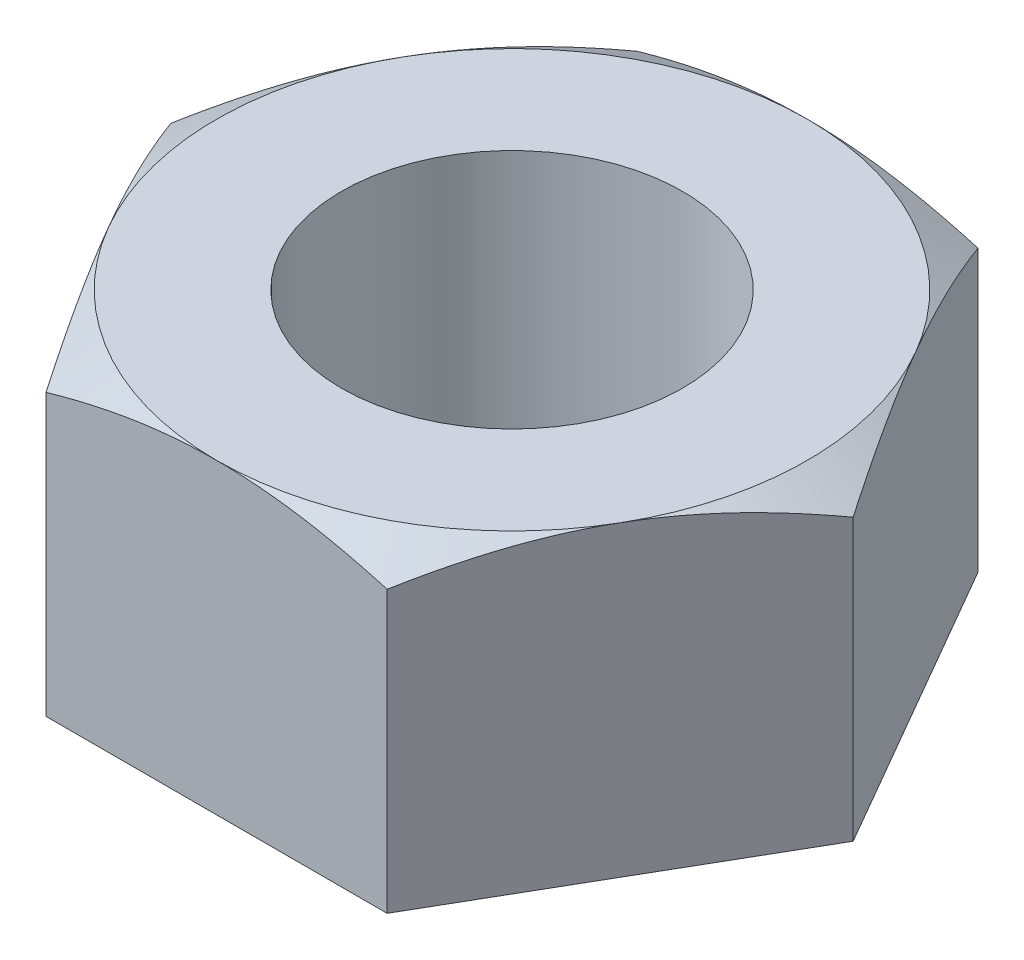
ISO-10303-21;
HEADER;
FILE_DESCRIPTION(('STEP AP214'),'2;1');
FILE_NAME('part.step','',(''),(''),'','','');
FILE_SCHEMA(('AUTOMOTIVE_DESIGN { 1 0 10303 214 1 1 1 1 }'));
ENDSEC;
DATA;
#1=APPLICATION_CONTEXT('core data for automotive mechanical design processes');
#2=APPLICATION_PROTOCOL_DEFINITION('international standard','automotive_design',2000,#1);
#3=PRODUCT_CONTEXT('',#1,'mechanical');
#4=PRODUCT('Part','Part','',(#3));
#5=PRODUCT_RELATED_PRODUCT_CATEGORY('part','',(#4));
#6=PRODUCT_DEFINITION_FORMATION('','',#4);
#7=PRODUCT_DEFINITION_CONTEXT('part definition',#1,'design');
#8=PRODUCT_DEFINITION('design','',#6,#7);
#9=PRODUCT_DEFINITION_SHAPE('','',#8);
#10=(LENGTH_UNIT() NAMED_UNIT(*) SI_UNIT(.MILLI.,.METRE.));
#11=(NAMED_UNIT(*) PLANE_ANGLE_UNIT() SI_UNIT($,.RADIAN.));
#12=(NAMED_UNIT(*) SI_UNIT($,.STERADIAN.) SOLID_ANGLE_UNIT());
#13=UNCERTAINTY_MEASURE_WITH_UNIT(LENGTH_MEASURE(1.E-05),#10,'distance_accuracy_value','');
#14=(GEOMETRIC_REPRESENTATION_CONTEXT(3) GLOBAL_UNCERTAINTY_ASSIGNED_CONTEXT((#13)) GLOBAL_UNIT_ASSIGNED_CONTEXT((#10,
#11,#12)) REPRESENTATION_CONTEXT('',''));
#15=CARTESIAN_POINT('',(0.,0.,0.));
#16=DIRECTION('',(0.,0.,1.));
#17=DIRECTION('',(1.,0.,0.));
#18=AXIS2_PLACEMENT_3D('',#15,#16,#17);
#19=CARTESIAN_POINT('',(9.99999999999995,9.,0.));
#20=DIRECTION('',(0.,1.,0.));
#21=DIRECTION('',(0.,0.,1.));
#22=AXIS2_PLACEMENT_3D('',#19,#20,#21);
#23=PLANE('',#22);
#24=CARTESIAN_POINT('',(0.,9.,0.));
#25=DIRECTION('',(0.,1.,0.));
#26=DIRECTION('',(0.,0.,1.));
#27=AXIS2_PLACEMENT_3D('',#24,#25,#26);
#28=CIRCLE('',#27,5.);
#29=CARTESIAN_POINT('',(0.,9.,5.));
#30=VERTEX_POINT('',#29);
#31=EDGE_CURVE('E245',#30,#30,#28,.T.);
#32=ORIENTED_EDGE('',*,*,#31,.F.);
#33=EDGE_LOOP('',(#32));
#34=FACE_BOUND('',#33,.T.);
#35=CARTESIAN_POINT('',(0.,9.,0.));
#36=DIRECTION('',(0.,1.,0.));
#37=DIRECTION('',(-1.,0.,0.));
#38=AXIS2_PLACEMENT_3D('',#35,#36,#37);
#39=CIRCLE('',#38,8.66025403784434);
#40=CARTESIAN_POINT('',(-7.49999999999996,8.99999999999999,4.33012701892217));
#41=VERTEX_POINT('',#40);
#42=CARTESIAN_POINT('',(0.,9.,8.66025403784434));
#43=VERTEX_POINT('',#42);
#44=EDGE_CURVE('E134',#41,#43,#39,.T.);
#45=ORIENTED_EDGE('',*,*,#44,.T.);
#46=CARTESIAN_POINT('',(7.49999999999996,9.,4.33012701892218));
#47=VERTEX_POINT('',#46);
#48=EDGE_CURVE('E118',#43,#47,#39,.T.);
#49=ORIENTED_EDGE('',*,*,#48,.T.);
#50=CARTESIAN_POINT('',(7.49999999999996,9.,-4.33012701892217));
#51=VERTEX_POINT('',#50);
#52=EDGE_CURVE('E108',#47,#51,#39,.T.);
#53=ORIENTED_EDGE('',*,*,#52,.T.);
#54=CARTESIAN_POINT('',(0.,9.,-8.66025403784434));
#55=VERTEX_POINT('',#54);
#56=EDGE_CURVE('E52',#51,#55,#39,.T.);
#57=ORIENTED_EDGE('',*,*,#56,.T.);
#58=CARTESIAN_POINT('',(-7.49999999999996,8.99999999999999,-4.33012701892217));
#59=VERTEX_POINT('',#58);
#60=EDGE_CURVE('E60',#55,#59,#39,.T.);
#61=ORIENTED_EDGE('',*,*,#60,.T.);
#62=EDGE_CURVE('E136',#59,#41,#39,.T.);
#63=ORIENTED_EDGE('',*,*,#62,.T.);
#64=EDGE_LOOP('',(#45,#49,#53,#57,#61,#63));
#65=FACE_BOUND('',#64,.T.);
#66=ADVANCED_FACE('F31',(#34,#65),#23,.T.);
#67=CARTESIAN_POINT('',(4.99999999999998,9.,8.66025403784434));
#68=DIRECTION('',(-0.866025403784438,0.,-0.5));
#69=DIRECTION('',(-0.5,0.,0.866025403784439));
#70=AXIS2_PLACEMENT_3D('',#67,#68,#69);
#71=PLANE('',#70);
#72=CARTESIAN_POINT('',(4.99988452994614,8.22643064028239,8.66045403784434));
#73=CARTESIAN_POINT('',(5.10978993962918,8.28987449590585,8.47009228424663));
#74=CARTESIAN_POINT('',(5.22010511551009,8.35043900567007,8.27902079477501));
#75=CARTESIAN_POINT('',(5.44163137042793,8.46501628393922,7.89532606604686));
#76=CARTESIAN_POINT('',(5.55284281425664,8.51902622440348,7.70270219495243));
#77=CARTESIAN_POINT('',(5.88825776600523,8.67016394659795,7.12174645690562));
#78=CARTESIAN_POINT('',(6.11378530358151,8.75612903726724,6.7311213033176));
#79=CARTESIAN_POINT('',(6.45128290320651,8.85693311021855,6.14655831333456));
#80=CARTESIAN_POINT('',(6.56224470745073,8.88564924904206,5.95436683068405));
#81=CARTESIAN_POINT('',(6.78467011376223,8.93380128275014,5.56911472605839));
#82=CARTESIAN_POINT('',(6.89613367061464,8.95323799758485,5.37605418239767));
#83=CARTESIAN_POINT('',(7.11925270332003,8.98233858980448,4.98960068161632));
#84=CARTESIAN_POINT('',(7.23090781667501,8.99201355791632,4.79620835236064));
#85=CARTESIAN_POINT('',(7.45432118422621,9.00138323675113,4.4092450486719));
#86=CARTESIAN_POINT('',(7.5660794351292,9.00107825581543,4.21567407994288));
#87=CARTESIAN_POINT('',(7.77501507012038,8.99118224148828,3.85378694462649));
#88=CARTESIAN_POINT('',(7.87220719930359,8.98279838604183,3.68544523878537));
#89=CARTESIAN_POINT('',(8.0663638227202,8.95864535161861,3.34915610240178));
#90=CARTESIAN_POINT('',(8.16332830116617,8.94287567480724,3.18120869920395));
#91=CARTESIAN_POINT('',(8.45384634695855,8.88486066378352,2.67801668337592));
#92=CARTESIAN_POINT('',(8.64688567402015,8.83191659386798,2.34366276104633));
#93=CARTESIAN_POINT('',(9.03501203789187,8.69955567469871,1.67140817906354));
#94=CARTESIAN_POINT('',(9.23004954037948,8.61957775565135,1.33359331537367));
#95=CARTESIAN_POINT('',(9.61721603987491,8.43806099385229,0.663001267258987));
#96=CARTESIAN_POINT('',(9.80934999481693,8.33656478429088,0.330215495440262));
#97=CARTESIAN_POINT('',(10.0001154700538,8.22643064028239,-0.000199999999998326));
#98=B_SPLINE_CURVE_WITH_KNOTS('',3,(#72,#73,#74,#75,#76,#77,#78,#79,#80,#81,#82,#83,#84,#85,#86,
#87,#88,#89,#90,#91,#92,#93,#94,#95,#96,#97),.UNSPECIFIED.,.F.,.F.,(4,2,2,2,2,2,2,2,2,2,2,2,4),
(0.,0.686295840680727,1.37288674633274,2.74892125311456,3.42008636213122,4.09119215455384,
4.76153461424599,5.43185636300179,6.01540583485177,6.5989946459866,7.76700355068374,
8.96091644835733,10.1524856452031),.UNSPECIFIED.);
#99=CARTESIAN_POINT('',(4.99999999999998,8.22649730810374,8.66025403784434));
#100=VERTEX_POINT('',#99);
#101=EDGE_CURVE('E123',#100,#47,#98,.T.);
#102=ORIENTED_EDGE('',*,*,#101,.F.);
#103=DIRECTION('',(0.,-1.,0.));
#104=VECTOR('',#103,1.);
#105=CARTESIAN_POINT('',(4.99999999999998,9.,8.66025403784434));
#106=LINE('',#105,#104);
#107=CARTESIAN_POINT('',(4.99999999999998,0.,8.66025403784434));
#108=VERTEX_POINT('',#107);
#109=EDGE_CURVE('E223',#100,#108,#106,.T.);
#110=ORIENTED_EDGE('',*,*,#109,.T.);
#111=DIRECTION('',(0.5,0.,-0.866025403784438));
#112=VECTOR('',#111,1.);
#113=CARTESIAN_POINT('',(4.99999999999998,0.,8.66025403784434));
#114=LINE('',#113,#112);
#115=CARTESIAN_POINT('',(9.99999999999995,0.,0.));
#116=VERTEX_POINT('',#115);
#117=EDGE_CURVE('E240',#108,#116,#114,.T.);
#118=ORIENTED_EDGE('',*,*,#117,.T.);
#119=DIRECTION('',(0.,-1.,0.));
#120=VECTOR('',#119,1.);
#121=CARTESIAN_POINT('',(9.99999999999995,9.,0.));
#122=LINE('',#121,#120);
#123=CARTESIAN_POINT('',(9.99999999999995,8.22649730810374,0.));
#124=VERTEX_POINT('',#123);
#125=EDGE_CURVE('E131',#124,#116,#122,.T.);
#126=ORIENTED_EDGE('',*,*,#125,.F.);
#127=EDGE_CURVE('E112',#47,#124,#98,.T.);
#128=ORIENTED_EDGE('',*,*,#127,.F.);
#129=EDGE_LOOP('',(#102,#110,#118,#126,#128));
#130=FACE_BOUND('',#129,.T.);
#131=ADVANCED_FACE('F33',(#130),#71,.F.);
#132=CARTESIAN_POINT('',(9.99999999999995,9.,0.));
#133=DIRECTION('',(-0.866025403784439,0.,0.5));
#134=DIRECTION('',(0.5,0.,0.866025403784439));
#135=AXIS2_PLACEMENT_3D('',#132,#133,#134);
#136=PLANE('',#135);
#137=CARTESIAN_POINT('',(10.0001154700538,8.22643064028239,0.000200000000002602));
#138=CARTESIAN_POINT('',(9.89021006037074,8.28987449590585,-0.190161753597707));
#139=CARTESIAN_POINT('',(9.77989488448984,8.35043900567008,-0.38123324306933));
#140=CARTESIAN_POINT('',(9.558368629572,8.46501628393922,-0.764927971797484));
#141=CARTESIAN_POINT('',(9.44715718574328,8.51902622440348,-0.957551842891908));
#142=CARTESIAN_POINT('',(9.1117422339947,8.67016394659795,-1.53850758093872));
#143=CARTESIAN_POINT('',(8.88621469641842,8.75612903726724,-1.92913273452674));
#144=CARTESIAN_POINT('',(8.54871709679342,8.85693311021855,-2.51369572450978));
#145=CARTESIAN_POINT('',(8.43775529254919,8.88564924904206,-2.70588720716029));
#146=CARTESIAN_POINT('',(8.2153298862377,8.93380128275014,-3.09113931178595));
#147=CARTESIAN_POINT('',(8.10386632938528,8.95323799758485,-3.28419985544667));
#148=CARTESIAN_POINT('',(7.8807472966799,8.98233858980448,-3.67065335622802));
#149=CARTESIAN_POINT('',(7.76909218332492,8.99201355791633,-3.8640456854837));
#150=CARTESIAN_POINT('',(7.54567881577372,9.00138323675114,-4.25100898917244));
#151=CARTESIAN_POINT('',(7.43392056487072,9.00107825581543,-4.44457995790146));
#152=CARTESIAN_POINT('',(7.22498492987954,8.99118224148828,-4.80646709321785));
#153=CARTESIAN_POINT('',(7.12779280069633,8.98279838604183,-4.97480879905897));
#154=CARTESIAN_POINT('',(6.93363617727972,8.95864535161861,-5.31109793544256));
#155=CARTESIAN_POINT('',(6.83667169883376,8.94287567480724,-5.47904533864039));
#156=CARTESIAN_POINT('',(6.54615365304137,8.88486066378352,-5.98223735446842));
#157=CARTESIAN_POINT('',(6.35311432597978,8.83191659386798,-6.31659127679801));
#158=CARTESIAN_POINT('',(5.96498796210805,8.69955567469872,-6.9888458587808));
#159=CARTESIAN_POINT('',(5.76995045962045,8.61957775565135,-7.32666072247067));
#160=CARTESIAN_POINT('',(5.38278396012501,8.43806099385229,-7.99725277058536));
#161=CARTESIAN_POINT('',(5.19065000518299,8.33656478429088,-8.33003854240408));
#162=CARTESIAN_POINT('',(4.99988452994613,8.22643064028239,-8.66045403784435));
#163=B_SPLINE_CURVE_WITH_KNOTS('',3,(#137,#138,#139,#140,#141,#142,#143,#144,#145,#146,#147,
#148,#149,#150,#151,#152,#153,#154,#155,#156,#157,#158,#159,#160,#161,#162),.UNSPECIFIED.,.F.,
.F.,(4,2,2,2,2,2,2,2,2,2,2,2,4),(0.,0.686295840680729,1.37288674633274,2.74892125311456,
3.42008636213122,4.09119215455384,4.76153461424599,5.43185636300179,6.01540583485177,
6.5989946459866,7.76700355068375,8.96091644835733,10.1524856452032),.UNSPECIFIED.);
#164=EDGE_CURVE('E114',#124,#51,#163,.T.);
#165=ORIENTED_EDGE('',*,*,#164,.F.);
#166=ORIENTED_EDGE('',*,*,#125,.T.);
#167=DIRECTION('',(-0.5,0.,-0.866025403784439));
#168=VECTOR('',#167,1.);
#169=CARTESIAN_POINT('',(9.99999999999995,0.,0.));
#170=LINE('',#169,#168);
#171=CARTESIAN_POINT('',(4.99999999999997,0.,-8.66025403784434));
#172=VERTEX_POINT('',#171);
#173=EDGE_CURVE('E236',#116,#172,#170,.T.);
#174=ORIENTED_EDGE('',*,*,#173,.T.);
#175=DIRECTION('',(0.,-1.,0.));
#176=VECTOR('',#175,1.);
#177=CARTESIAN_POINT('',(4.99999999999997,9.,-8.66025403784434));
#178=LINE('',#177,#176);
#179=CARTESIAN_POINT('',(4.99999999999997,8.22649730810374,-8.66025403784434));
#180=VERTEX_POINT('',#179);
#181=EDGE_CURVE('E232',#180,#172,#178,.T.);
#182=ORIENTED_EDGE('',*,*,#181,.F.);
#183=EDGE_CURVE('E169',#51,#180,#163,.T.);
#184=ORIENTED_EDGE('',*,*,#183,.F.);
#185=EDGE_LOOP('',(#165,#166,#174,#182,#184));
#186=FACE_BOUND('',#185,.T.);
#187=ADVANCED_FACE('F178',(#186),#136,.F.);
#188=CARTESIAN_POINT('',(4.99999999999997,9.,-8.66025403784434));
#189=DIRECTION('',(0.,0.,1.));
#190=DIRECTION('',(1.,0.,0.));
#191=AXIS2_PLACEMENT_3D('',#188,#189,#190);
#192=PLANE('',#191);
#193=CARTESIAN_POINT('',(-13.4361399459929,4.77088200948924,-8.66025403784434));
#194=CARTESIAN_POINT('',(-13.0578512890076,4.95440814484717,-8.66025403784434));
#195=CARTESIAN_POINT('',(-12.6786948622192,5.13617619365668,-8.66025403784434));
#196=CARTESIAN_POINT('',(-11.918185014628,5.49520747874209,-8.66025403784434));
#197=CARTESIAN_POINT('',(-11.5368312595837,5.67247000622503,-8.66025403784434));
#198=CARTESIAN_POINT('',(-10.7695030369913,6.0223922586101,-8.66025403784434));
#199=CARTESIAN_POINT('',(-10.3835147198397,6.19502171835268,-8.66025403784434));
#200=CARTESIAN_POINT('',(-9.60847017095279,6.5332237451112,-8.66025403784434));
#201=CARTESIAN_POINT('',(-9.219414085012,6.69879664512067,-8.66025403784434));
#202=CARTESIAN_POINT('',(-8.42501869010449,7.02621442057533,-8.66025403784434));
#203=CARTESIAN_POINT('',(-8.01955846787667,7.18776755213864,-8.66025403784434));
#204=CARTESIAN_POINT('',(-7.20389738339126,7.49866032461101,-8.66025403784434));
#205=CARTESIAN_POINT('',(-6.79369599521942,7.64799859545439,-8.66025403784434));
#206=CARTESIAN_POINT('',(-5.96866106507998,7.93054473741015,-8.66025403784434));
#207=CARTESIAN_POINT('',(-5.55383881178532,8.06378521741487,-8.66025403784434));
#208=CARTESIAN_POINT('',(-4.71825861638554,8.3098656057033,-8.66025403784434));
#209=CARTESIAN_POINT('',(-4.29750258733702,8.42271193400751,-8.66025403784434));
#210=CARTESIAN_POINT('',(-3.45209188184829,8.62198180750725,-8.66025403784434));
#211=CARTESIAN_POINT('',(-3.02747209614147,8.70854938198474,-8.66025403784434));
#212=CARTESIAN_POINT('',(-2.3866711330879,8.81494892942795,-8.66025403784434));
#213=CARTESIAN_POINT('',(-2.17240986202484,8.84650825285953,-8.66025403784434));
#214=CARTESIAN_POINT('',(-1.74282044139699,8.90119073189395,-8.66025403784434));
#215=CARTESIAN_POINT('',(-1.52749239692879,8.92431470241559,-8.66025403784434));
#216=CARTESIAN_POINT('',(-1.0988729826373,8.96137551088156,-8.66025403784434));
#217=CARTESIAN_POINT('',(-0.885591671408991,8.97542822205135,-8.66025403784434));
#218=CARTESIAN_POINT('',(-0.458625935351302,8.99450163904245,-8.66025403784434));
#219=CARTESIAN_POINT('',(-0.244941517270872,8.99952249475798,-8.66025403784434));
#220=CARTESIAN_POINT('',(0.182448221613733,9.00041241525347,-8.66025403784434));
#221=CARTESIAN_POINT('',(0.396153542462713,8.99628145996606,-8.66025403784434));
#222=CARTESIAN_POINT('',(0.823199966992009,8.97896878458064,-8.66025403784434));
#223=CARTESIAN_POINT('',(1.03654105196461,8.9657866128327,-8.66025403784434));
#224=CARTESIAN_POINT('',(1.54910835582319,8.92352117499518,-8.66025403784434));
#225=CARTESIAN_POINT('',(1.84798863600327,8.89015205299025,-8.66025403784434));
#226=CARTESIAN_POINT('',(2.4435203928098,8.80746877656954,-8.66025403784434));
#227=CARTESIAN_POINT('',(2.74017156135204,8.75815245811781,-8.66025403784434));
#228=CARTESIAN_POINT('',(3.62644918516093,8.58889859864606,-8.66025403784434));
#229=CARTESIAN_POINT('',(4.21206612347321,8.44768729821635,-8.66025403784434));
#230=CARTESIAN_POINT('',(5.08769813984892,8.20294740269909,-8.66025403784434));
#231=CARTESIAN_POINT('',(5.38225885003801,8.11474781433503,-8.66025403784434));
#232=CARTESIAN_POINT('',(5.96851924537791,7.92921935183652,-8.66025403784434));
#233=CARTESIAN_POINT('',(6.26021891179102,7.83189041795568,-8.66025403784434));
#234=CARTESIAN_POINT('',(6.84084926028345,7.62966221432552,-8.66025403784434));
#235=CARTESIAN_POINT('',(7.12978082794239,7.52476546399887,-8.66025403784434));
#236=CARTESIAN_POINT('',(7.70525253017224,7.30863266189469,-8.66025403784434));
#237=CARTESIAN_POINT('',(7.99179269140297,7.19739668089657,-8.66025403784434));
#238=CARTESIAN_POINT('',(8.66233320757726,6.92991224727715,-8.66025403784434));
#239=CARTESIAN_POINT('',(9.04546731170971,6.77149640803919,-8.66025403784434));
#240=CARTESIAN_POINT('',(9.80851455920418,6.4470666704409,-8.66025403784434));
#241=CARTESIAN_POINT('',(10.188427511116,6.28105232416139,-8.66025403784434));
#242=CARTESIAN_POINT('',(10.9456241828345,5.94293063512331,-8.66025403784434));
#243=CARTESIAN_POINT('',(11.3229073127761,5.77082197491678,-8.66025403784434));
#244=CARTESIAN_POINT('',(12.0751953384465,5.42172722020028,-8.66025403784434));
#245=CARTESIAN_POINT('',(12.4502002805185,5.24474122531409,-8.66025403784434));
#246=CARTESIAN_POINT('',(13.1987062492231,4.88660459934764,-8.66025403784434));
#247=CARTESIAN_POINT('',(13.5722052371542,4.70544971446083,-8.66025403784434));
#248=CARTESIAN_POINT('',(14.3175954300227,4.33985885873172,-8.66025403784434));
#249=CARTESIAN_POINT('',(14.689486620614,4.15542285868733,-8.66025403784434));
#250=CARTESIAN_POINT('',(15.8030321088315,3.59810573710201,-8.66025403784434));
#251=CARTESIAN_POINT('',(16.5426560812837,3.2211683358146,-8.66025403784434));
#252=CARTESIAN_POINT('',(17.9569285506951,2.49116325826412,-8.66025403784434));
#253=CARTESIAN_POINT('',(18.6318906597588,2.13870045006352,-8.66025403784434));
#254=CARTESIAN_POINT('',(19.9792869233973,1.42892325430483,-8.66025403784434));
#255=CARTESIAN_POINT('',(20.6517209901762,1.07160870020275,-8.66025403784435));
#256=CARTESIAN_POINT('',(21.9929622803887,0.354161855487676,-8.66025403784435));
#257=CARTESIAN_POINT('',(22.6617743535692,-0.0059613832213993,-8.66025403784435));
#258=CARTESIAN_POINT('',(23.9977785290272,-0.729115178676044,-8.66025403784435));
#259=CARTESIAN_POINT('',(24.66497071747,-1.09214557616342,-8.66025403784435));
#260=CARTESIAN_POINT('',(25.3315651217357,-1.45626293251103,-8.66025403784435));
#261=B_SPLINE_CURVE_WITH_KNOTS('',3,(#193,#194,#195,#196,#197,#198,#199,#200,#201,#202,#203,
#204,#205,#206,#207,#208,#209,#210,#211,#212,#213,#214,#215,#216,#217,#218,#219,#220,#221,#222,
#223,#224,#225,#226,#227,#228,#229,#230,#231,#232,#233,#234,#235,#236,#237,#238,#239,#240,#241,
#242,#243,#244,#245,#246,#247,#248,#249,#250,#251,#252,#253,#254,#255,#256,#257,#258,#259,#260),
.UNSPECIFIED.,.F.,.F.,(4,2,2,2,2,2,2,2,2,2,2,2,2,2,2,2,2,2,2,2,2,2,2,2,2,2,2,2,2,2,2,2,2,4),(0.,
1.26138658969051,2.52297040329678,3.79141338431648,5.05979644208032,6.36902398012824,
7.67839816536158,8.98507385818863,10.2913374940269,11.5903067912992,12.2398860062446,
12.8894024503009,13.5304488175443,14.171484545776,14.8125216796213,15.453590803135,
16.3552932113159,17.257118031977,19.0617684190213,19.9841377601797,20.9065131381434,
21.8285828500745,22.7506422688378,23.9943113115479,25.2380537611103,26.4820667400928,
27.7260543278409,28.9713730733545,30.2167029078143,32.7070369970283,34.9913615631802,
37.2757647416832,39.5545692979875,41.8332498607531),.UNSPECIFIED.);
#262=EDGE_CURVE('E173',#180,#55,#261,.F.);
#263=ORIENTED_EDGE('',*,*,#262,.F.);
#264=ORIENTED_EDGE('',*,*,#181,.T.);
#265=DIRECTION('',(-1.,0.,0.));
#266=VECTOR('',#265,1.);
#267=CARTESIAN_POINT('',(4.99999999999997,0.,-8.66025403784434));
#268=LINE('',#267,#266);
#269=CARTESIAN_POINT('',(-4.99999999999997,0.,-8.66025403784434));
#270=VERTEX_POINT('',#269);
#271=EDGE_CURVE('E243',#172,#270,#268,.T.);
#272=ORIENTED_EDGE('',*,*,#271,.T.);
#273=DIRECTION('',(0.,-1.,0.));
#274=VECTOR('',#273,1.);
#275=CARTESIAN_POINT('',(-4.99999999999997,9.,-8.66025403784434));
#276=LINE('',#275,#274);
#277=CARTESIAN_POINT('',(-4.99999999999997,8.22649730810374,-8.66025403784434));
#278=VERTEX_POINT('',#277);
#279=EDGE_CURVE('E225',#278,#270,#276,.T.);
#280=ORIENTED_EDGE('',*,*,#279,.F.);
#281=EDGE_CURVE('E163',#55,#278,#261,.F.);
#282=ORIENTED_EDGE('',*,*,#281,.F.);
#283=EDGE_LOOP('',(#263,#264,#272,#280,#282));
#284=FACE_BOUND('',#283,.T.);
#285=ADVANCED_FACE('F181',(#284),#192,.F.);
#286=CARTESIAN_POINT('',(-4.99999999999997,9.,-8.66025403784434));
#287=DIRECTION('',(0.866025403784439,0.,0.5));
#288=DIRECTION('',(0.5,0.,-0.866025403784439));
#289=AXIS2_PLACEMENT_3D('',#286,#287,#288);
#290=PLANE('',#289);
#291=CARTESIAN_POINT('',(-4.99988452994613,8.22643064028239,-8.66045403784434));
#292=CARTESIAN_POINT('',(-5.10978993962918,8.28987449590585,-8.47009228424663));
#293=CARTESIAN_POINT('',(-5.22010511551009,8.35043900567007,-8.27902079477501));
#294=CARTESIAN_POINT('',(-5.44163137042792,8.46501628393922,-7.89532606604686));
#295=CARTESIAN_POINT('',(-5.55284281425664,8.51902622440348,-7.70270219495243));
#296=CARTESIAN_POINT('',(-5.88825776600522,8.67016394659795,-7.12174645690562));
#297=CARTESIAN_POINT('',(-6.11378530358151,8.75612903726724,-6.7311213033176));
#298=CARTESIAN_POINT('',(-6.45128290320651,8.85693311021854,-6.14655831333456));
#299=CARTESIAN_POINT('',(-6.56224470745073,8.88564924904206,-5.95436683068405));
#300=CARTESIAN_POINT('',(-6.78467011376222,8.93380128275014,-5.56911472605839));
#301=CARTESIAN_POINT('',(-6.89613367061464,8.95323799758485,-5.37605418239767));
#302=CARTESIAN_POINT('',(-7.11925270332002,8.98233858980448,-4.98960068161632));
#303=CARTESIAN_POINT('',(-7.230907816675,8.99201355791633,-4.79620835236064));
#304=CARTESIAN_POINT('',(-7.4543211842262,9.00138323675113,-4.4092450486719));
#305=CARTESIAN_POINT('',(-7.5660794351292,9.00107825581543,-4.21567407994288));
#306=CARTESIAN_POINT('',(-7.77501507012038,8.99118224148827,-3.85378694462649));
#307=CARTESIAN_POINT('',(-7.87220719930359,8.98279838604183,-3.68544523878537));
#308=CARTESIAN_POINT('',(-8.0663638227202,8.95864535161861,-3.34915610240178));
#309=CARTESIAN_POINT('',(-8.16332830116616,8.94287567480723,-3.18120869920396));
#310=CARTESIAN_POINT('',(-8.45384634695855,8.88486066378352,-2.67801668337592));
#311=CARTESIAN_POINT('',(-8.64688567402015,8.83191659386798,-2.34366276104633));
#312=CARTESIAN_POINT('',(-9.03501203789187,8.69955567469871,-1.67140817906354));
#313=CARTESIAN_POINT('',(-9.23004954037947,8.61957775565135,-1.33359331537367));
#314=CARTESIAN_POINT('',(-9.61721603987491,8.43806099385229,-0.663001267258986));
#315=CARTESIAN_POINT('',(-9.80934999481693,8.33656478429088,-0.330215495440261));
#316=CARTESIAN_POINT('',(-10.0001154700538,8.22643064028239,0.000200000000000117));
#317=B_SPLINE_CURVE_WITH_KNOTS('',3,(#291,#292,#293,#294,#295,#296,#297,#298,#299,#300,#301,
#302,#303,#304,#305,#306,#307,#308,#309,#310,#311,#312,#313,#314,#315,#316),.UNSPECIFIED.,.F.,
.F.,(4,2,2,2,2,2,2,2,2,2,2,2,4),(0.,0.686295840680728,1.37288674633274,2.74892125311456,
3.42008636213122,4.09119215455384,4.76153461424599,5.43185636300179,6.01540583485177,
6.5989946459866,7.76700355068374,8.96091644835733,10.1524856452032),.UNSPECIFIED.);
#318=EDGE_CURVE('E257',#278,#59,#317,.T.);
#319=ORIENTED_EDGE('',*,*,#318,.F.);
#320=ORIENTED_EDGE('',*,*,#279,.T.);
#321=DIRECTION('',(-0.5,0.,0.866025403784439));
#322=VECTOR('',#321,1.);
#323=CARTESIAN_POINT('',(-4.99999999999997,0.,-8.66025403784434));
#324=LINE('',#323,#322);
#325=CARTESIAN_POINT('',(-9.99999999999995,0.,0.));
#326=VERTEX_POINT('',#325);
#327=EDGE_CURVE('E251',#270,#326,#324,.T.);
#328=ORIENTED_EDGE('',*,*,#327,.T.);
#329=DIRECTION('',(0.,-1.,0.));
#330=VECTOR('',#329,1.);
#331=CARTESIAN_POINT('',(-9.99999999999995,9.,0.));
#332=LINE('',#331,#330);
#333=CARTESIAN_POINT('',(-9.99999999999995,8.22649730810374,0.));
#334=VERTEX_POINT('',#333);
#335=EDGE_CURVE('E222',#334,#326,#332,.T.);
#336=ORIENTED_EDGE('',*,*,#335,.F.);
#337=EDGE_CURVE('E144',#59,#334,#317,.T.);
#338=ORIENTED_EDGE('',*,*,#337,.F.);
#339=EDGE_LOOP('',(#319,#320,#328,#336,#338));
#340=FACE_BOUND('',#339,.T.);
#341=ADVANCED_FACE('F185',(#340),#290,.F.);
#342=CARTESIAN_POINT('',(-9.99999999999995,9.,0.));
#343=DIRECTION('',(0.866025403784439,0.,-0.5));
#344=DIRECTION('',(-0.5,0.,-0.866025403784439));
#345=AXIS2_PLACEMENT_3D('',#342,#343,#344);
#346=PLANE('',#345);
#347=CARTESIAN_POINT('',(-10.0001154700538,8.22643064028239,-0.000199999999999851));
#348=CARTESIAN_POINT('',(-9.89021006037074,8.28987449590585,0.190161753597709));
#349=CARTESIAN_POINT('',(-9.77989488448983,8.35043900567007,0.381233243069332));
#350=CARTESIAN_POINT('',(-9.558368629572,8.46501628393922,0.764927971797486));
#351=CARTESIAN_POINT('',(-9.44715718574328,8.51902622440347,0.957551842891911));
#352=CARTESIAN_POINT('',(-9.1117422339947,8.67016394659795,1.53850758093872));
#353=CARTESIAN_POINT('',(-8.88621469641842,8.75612903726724,1.92913273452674));
#354=CARTESIAN_POINT('',(-8.54871709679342,8.85693311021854,2.51369572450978));
#355=CARTESIAN_POINT('',(-8.43775529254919,8.88564924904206,2.70588720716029));
#356=CARTESIAN_POINT('',(-8.2153298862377,8.93380128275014,3.09113931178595));
#357=CARTESIAN_POINT('',(-8.10386632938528,8.95323799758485,3.28419985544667));
#358=CARTESIAN_POINT('',(-7.8807472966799,8.98233858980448,3.67065335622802));
#359=CARTESIAN_POINT('',(-7.76909218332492,8.99201355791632,3.8640456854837));
#360=CARTESIAN_POINT('',(-7.54567881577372,9.00138323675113,4.25100898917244));
#361=CARTESIAN_POINT('',(-7.43392056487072,9.00107825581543,4.44457995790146));
#362=CARTESIAN_POINT('',(-7.22498492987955,8.99118224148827,4.80646709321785));
#363=CARTESIAN_POINT('',(-7.12779280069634,8.98279838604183,4.97480879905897));
#364=CARTESIAN_POINT('',(-6.93363617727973,8.9586453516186,5.31109793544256));
#365=CARTESIAN_POINT('',(-6.83667169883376,8.94287567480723,5.47904533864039));
#366=CARTESIAN_POINT('',(-6.54615365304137,8.88486066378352,5.98223735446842));
#367=CARTESIAN_POINT('',(-6.35311432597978,8.83191659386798,6.31659127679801));
#368=CARTESIAN_POINT('',(-5.96498796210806,8.69955567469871,6.9888458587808));
#369=CARTESIAN_POINT('',(-5.76995045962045,8.61957775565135,7.32666072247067));
#370=CARTESIAN_POINT('',(-5.38278396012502,8.43806099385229,7.99725277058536));
#371=CARTESIAN_POINT('',(-5.190650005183,8.33656478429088,8.33003854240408));
#372=CARTESIAN_POINT('',(-4.99988452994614,8.22643064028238,8.66045403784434));
#373=B_SPLINE_CURVE_WITH_KNOTS('',3,(#347,#348,#349,#350,#351,#352,#353,#354,#355,#356,#357,
#358,#359,#360,#361,#362,#363,#364,#365,#366,#367,#368,#369,#370,#371,#372),.UNSPECIFIED.,.F.,
.F.,(4,2,2,2,2,2,2,2,2,2,2,2,4),(0.,0.686295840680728,1.37288674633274,2.74892125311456,
3.42008636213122,4.09119215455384,4.76153461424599,5.43185636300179,6.01540583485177,
6.5989946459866,7.76700355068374,8.96091644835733,10.1524856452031),.UNSPECIFIED.);
#374=EDGE_CURVE('E143',#334,#41,#373,.T.);
#375=ORIENTED_EDGE('',*,*,#374,.F.);
#376=ORIENTED_EDGE('',*,*,#335,.T.);
#377=DIRECTION('',(0.5,0.,0.866025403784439));
#378=VECTOR('',#377,1.);
#379=CARTESIAN_POINT('',(-9.99999999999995,0.,0.));
#380=LINE('',#379,#378);
#381=CARTESIAN_POINT('',(-4.99999999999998,0.,8.66025403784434));
#382=VERTEX_POINT('',#381);
#383=EDGE_CURVE('E220',#326,#382,#380,.T.);
#384=ORIENTED_EDGE('',*,*,#383,.T.);
#385=DIRECTION('',(0.,-1.,0.));
#386=VECTOR('',#385,1.);
#387=CARTESIAN_POINT('',(-4.99999999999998,9.,8.66025403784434));
#388=LINE('',#387,#386);
#389=CARTESIAN_POINT('',(-4.99999999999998,8.22649730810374,8.66025403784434));
#390=VERTEX_POINT('',#389);
#391=EDGE_CURVE('E214',#390,#382,#388,.T.);
#392=ORIENTED_EDGE('',*,*,#391,.F.);
#393=EDGE_CURVE('E135',#41,#390,#373,.T.);
#394=ORIENTED_EDGE('',*,*,#393,.F.);
#395=EDGE_LOOP('',(#375,#376,#384,#392,#394));
#396=FACE_BOUND('',#395,.T.);
#397=ADVANCED_FACE('F150',(#396),#346,.F.);
#398=CARTESIAN_POINT('',(-4.99999999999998,9.,8.66025403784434));
#399=DIRECTION('',(0.,0.,-1.));
#400=DIRECTION('',(-1.,0.,0.));
#401=AXIS2_PLACEMENT_3D('',#398,#399,#400);
#402=PLANE('',#401);
#403=CARTESIAN_POINT('',(-13.4361399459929,4.77088200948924,8.66025403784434));
#404=CARTESIAN_POINT('',(-13.0578512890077,4.95440814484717,8.66025403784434));
#405=CARTESIAN_POINT('',(-12.6786948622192,5.13617619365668,8.66025403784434));
#406=CARTESIAN_POINT('',(-11.918185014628,5.49520747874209,8.66025403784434));
#407=CARTESIAN_POINT('',(-11.5368312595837,5.67247000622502,8.66025403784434));
#408=CARTESIAN_POINT('',(-10.7695030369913,6.0223922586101,8.66025403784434));
#409=CARTESIAN_POINT('',(-10.3835147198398,6.19502171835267,8.66025403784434));
#410=CARTESIAN_POINT('',(-9.6084701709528,6.53322374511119,8.66025403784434));
#411=CARTESIAN_POINT('',(-9.21941408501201,6.69879664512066,8.66025403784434));
#412=CARTESIAN_POINT('',(-8.4250186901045,7.02621442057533,8.66025403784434));
#413=CARTESIAN_POINT('',(-8.01955846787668,7.18776755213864,8.66025403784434));
#414=CARTESIAN_POINT('',(-7.20389738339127,7.498660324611,8.66025403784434));
#415=CARTESIAN_POINT('',(-6.79369599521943,7.64799859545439,8.66025403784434));
#416=CARTESIAN_POINT('',(-5.96866106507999,7.93054473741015,8.66025403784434));
#417=CARTESIAN_POINT('',(-5.55383881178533,8.06378521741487,8.66025403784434));
#418=CARTESIAN_POINT('',(-4.71825861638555,8.3098656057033,8.66025403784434));
#419=CARTESIAN_POINT('',(-4.29750258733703,8.42271193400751,8.66025403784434));
#420=CARTESIAN_POINT('',(-3.4520918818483,8.62198180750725,8.66025403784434));
#421=CARTESIAN_POINT('',(-3.02747209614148,8.70854938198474,8.66025403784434));
#422=CARTESIAN_POINT('',(-2.38667113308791,8.81494892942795,8.66025403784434));
#423=CARTESIAN_POINT('',(-2.17240986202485,8.84650825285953,8.66025403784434));
#424=CARTESIAN_POINT('',(-1.742820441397,8.90119073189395,8.66025403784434));
#425=CARTESIAN_POINT('',(-1.5274923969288,8.92431470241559,8.66025403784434));
#426=CARTESIAN_POINT('',(-1.09887298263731,8.96137551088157,8.66025403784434));
#427=CARTESIAN_POINT('',(-0.885591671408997,8.97542822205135,8.66025403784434));
#428=CARTESIAN_POINT('',(-0.458625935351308,8.99450163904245,8.66025403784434));
#429=CARTESIAN_POINT('',(-0.244941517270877,8.99952249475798,8.66025403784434));
#430=CARTESIAN_POINT('',(0.182448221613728,9.00041241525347,8.66025403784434));
#431=CARTESIAN_POINT('',(0.396153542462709,8.99628145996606,8.66025403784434));
#432=CARTESIAN_POINT('',(0.823199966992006,8.97896878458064,8.66025403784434));
#433=CARTESIAN_POINT('',(1.0365410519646,8.9657866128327,8.66025403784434));
#434=CARTESIAN_POINT('',(1.54910835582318,8.92352117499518,8.66025403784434));
#435=CARTESIAN_POINT('',(1.84798863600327,8.89015205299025,8.66025403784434));
#436=CARTESIAN_POINT('',(2.4435203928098,8.80746877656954,8.66025403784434));
#437=CARTESIAN_POINT('',(2.74017156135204,8.75815245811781,8.66025403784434));
#438=CARTESIAN_POINT('',(3.62644918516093,8.58889859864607,8.66025403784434));
#439=CARTESIAN_POINT('',(4.21206612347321,8.44768729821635,8.66025403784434));
#440=CARTESIAN_POINT('',(5.08769813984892,8.20294740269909,8.66025403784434));
#441=CARTESIAN_POINT('',(5.38225885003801,8.11474781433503,8.66025403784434));
#442=CARTESIAN_POINT('',(5.96851924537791,7.92921935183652,8.66025403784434));
#443=CARTESIAN_POINT('',(6.26021891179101,7.83189041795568,8.66025403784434));
#444=CARTESIAN_POINT('',(6.84084926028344,7.62966221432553,8.66025403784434));
#445=CARTESIAN_POINT('',(7.12978082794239,7.52476546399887,8.66025403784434));
#446=CARTESIAN_POINT('',(7.70525253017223,7.30863266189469,8.66025403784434));
#447=CARTESIAN_POINT('',(7.99179269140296,7.19739668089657,8.66025403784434));
#448=CARTESIAN_POINT('',(8.66233320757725,6.92991224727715,8.66025403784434));
#449=CARTESIAN_POINT('',(9.0454673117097,6.77149640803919,8.66025403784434));
#450=CARTESIAN_POINT('',(9.80851455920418,6.4470666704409,8.66025403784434));
#451=CARTESIAN_POINT('',(10.188427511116,6.2810523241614,8.66025403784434));
#452=CARTESIAN_POINT('',(10.9456241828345,5.94293063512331,8.66025403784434));
#453=CARTESIAN_POINT('',(11.3229073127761,5.77082197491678,8.66025403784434));
#454=CARTESIAN_POINT('',(12.0751953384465,5.42172722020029,8.66025403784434));
#455=CARTESIAN_POINT('',(12.4502002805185,5.2447412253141,8.66025403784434));
#456=CARTESIAN_POINT('',(13.1987062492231,4.88660459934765,8.66025403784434));
#457=CARTESIAN_POINT('',(13.5722052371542,4.70544971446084,8.66025403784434));
#458=CARTESIAN_POINT('',(14.3175954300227,4.33985885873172,8.66025403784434));
#459=CARTESIAN_POINT('',(14.6894866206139,4.15542285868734,8.66025403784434));
#460=CARTESIAN_POINT('',(15.8030321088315,3.59810573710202,8.66025403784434));
#461=CARTESIAN_POINT('',(16.5426560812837,3.22116833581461,8.66025403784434));
#462=CARTESIAN_POINT('',(17.9569285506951,2.49116325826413,8.66025403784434));
#463=CARTESIAN_POINT('',(18.6318906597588,2.13870045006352,8.66025403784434));
#464=CARTESIAN_POINT('',(19.9792869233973,1.42892325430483,8.66025403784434));
#465=CARTESIAN_POINT('',(20.6517209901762,1.07160870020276,8.66025403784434));
#466=CARTESIAN_POINT('',(21.9929622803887,0.354161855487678,8.66025403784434));
#467=CARTESIAN_POINT('',(22.6617743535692,-0.00596138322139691,8.66025403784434));
#468=CARTESIAN_POINT('',(23.9977785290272,-0.729115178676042,8.66025403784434));
#469=CARTESIAN_POINT('',(24.66497071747,-1.09214557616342,8.66025403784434));
#470=CARTESIAN_POINT('',(25.3315651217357,-1.45626293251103,8.66025403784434));
#471=B_SPLINE_CURVE_WITH_KNOTS('',3,(#403,#404,#405,#406,#407,#408,#409,#410,#411,#412,#413,
#414,#415,#416,#417,#418,#419,#420,#421,#422,#423,#424,#425,#426,#427,#428,#429,#430,#431,#432,
#433,#434,#435,#436,#437,#438,#439,#440,#441,#442,#443,#444,#445,#446,#447,#448,#449,#450,#451,
#452,#453,#454,#455,#456,#457,#458,#459,#460,#461,#462,#463,#464,#465,#466,#467,#468,#469,#470),
.UNSPECIFIED.,.F.,.F.,(4,2,2,2,2,2,2,2,2,2,2,2,2,2,2,2,2,2,2,2,2,2,2,2,2,2,2,2,2,2,2,2,2,4),(0.,
1.26138658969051,2.52297040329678,3.79141338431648,5.05979644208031,6.36902398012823,
7.67839816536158,8.98507385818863,10.2913374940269,11.5903067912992,12.2398860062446,
12.8894024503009,13.5304488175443,14.171484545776,14.8125216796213,15.453590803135,
16.3552932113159,17.257118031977,19.0617684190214,19.9841377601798,20.9065131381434,
21.8285828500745,22.7506422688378,23.9943113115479,25.2380537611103,26.4820667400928,
27.7260543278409,28.9713730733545,30.2167029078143,32.7070369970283,34.9913615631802,
37.2757647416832,39.5545692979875,41.8332498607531),.UNSPECIFIED.);
#472=EDGE_CURVE('E11',#390,#43,#471,.T.);
#473=ORIENTED_EDGE('',*,*,#472,.F.);
#474=ORIENTED_EDGE('',*,*,#391,.T.);
#475=DIRECTION('',(1.,0.,0.));
#476=VECTOR('',#475,1.);
#477=CARTESIAN_POINT('',(-4.99999999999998,0.,8.66025403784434));
#478=LINE('',#477,#476);
#479=EDGE_CURVE('E227',#382,#108,#478,.T.);
#480=ORIENTED_EDGE('',*,*,#479,.T.);
#481=ORIENTED_EDGE('',*,*,#109,.F.);
#482=EDGE_CURVE('E36',#43,#100,#471,.T.);
#483=ORIENTED_EDGE('',*,*,#482,.F.);
#484=EDGE_LOOP('',(#473,#474,#480,#481,#483));
#485=FACE_BOUND('',#484,.T.);
#486=ADVANCED_FACE('F193',(#485),#402,.F.);
#487=CARTESIAN_POINT('',(9.99999999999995,0.,0.));
#488=DIRECTION('',(0.,1.,0.));
#489=DIRECTION('',(0.,0.,1.));
#490=AXIS2_PLACEMENT_3D('',#487,#488,#489);
#491=PLANE('',#490);
#492=ORIENTED_EDGE('',*,*,#117,.F.);
#493=ORIENTED_EDGE('',*,*,#479,.F.);
#494=ORIENTED_EDGE('',*,*,#383,.F.);
#495=ORIENTED_EDGE('',*,*,#327,.F.);
#496=ORIENTED_EDGE('',*,*,#271,.F.);
#497=ORIENTED_EDGE('',*,*,#173,.F.);
#498=EDGE_LOOP('',(#492,#493,#494,#495,#496,#497));
#499=FACE_BOUND('',#498,.T.);
#500=CARTESIAN_POINT('',(0.,0.,0.));
#501=DIRECTION('',(0.,1.,0.));
#502=DIRECTION('',(0.,0.,1.));
#503=AXIS2_PLACEMENT_3D('',#500,#501,#502);
#504=CIRCLE('',#503,5.);
#505=CARTESIAN_POINT('',(0.,0.,5.));
#506=VERTEX_POINT('',#505);
#507=EDGE_CURVE('E127',#506,#506,#504,.T.);
#508=ORIENTED_EDGE('',*,*,#507,.T.);
#509=EDGE_LOOP('',(#508));
#510=FACE_BOUND('',#509,.T.);
#511=ADVANCED_FACE('F203',(#499,#510),#491,.F.);
#512=CARTESIAN_POINT('',(0.,9.,0.));
#513=DIRECTION('',(0.,-1.,0.));
#514=DIRECTION('',(0.,0.,-1.));
#515=AXIS2_PLACEMENT_3D('',#512,#513,#514);
#516=CYLINDRICAL_SURFACE('',#515,5.);
#517=ORIENTED_EDGE('',*,*,#31,.T.);
#518=EDGE_LOOP('',(#517));
#519=FACE_BOUND('',#518,.T.);
#520=ORIENTED_EDGE('',*,*,#507,.F.);
#521=EDGE_LOOP('',(#520));
#522=FACE_BOUND('',#521,.T.);
#523=ADVANCED_FACE('F156',(#519,#522),#516,.F.);
#524=CARTESIAN_POINT('',(0.,9.,0.));
#525=DIRECTION('',(0.,-1.,0.));
#526=DIRECTION('',(1.,0.,0.));
#527=AXIS2_PLACEMENT_3D('',#524,#525,#526);
#528=CONICAL_SURFACE('',#527,8.66025403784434,1.0471975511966);
#529=ORIENTED_EDGE('',*,*,#101,.T.);
#530=ORIENTED_EDGE('',*,*,#48,.F.);
#531=ORIENTED_EDGE('',*,*,#482,.T.);
#532=EDGE_LOOP('',(#529,#530,#531));
#533=FACE_BOUND('',#532,.T.);
#534=ADVANCED_FACE('F124',(#533),#528,.T.);
#535=ORIENTED_EDGE('',*,*,#393,.T.);
#536=ORIENTED_EDGE('',*,*,#472,.T.);
#537=ORIENTED_EDGE('',*,*,#44,.F.);
#538=EDGE_LOOP('',(#535,#536,#537));
#539=FACE_BOUND('',#538,.T.);
#540=ADVANCED_FACE('F155',(#539),#528,.T.);
#541=ORIENTED_EDGE('',*,*,#337,.T.);
#542=ORIENTED_EDGE('',*,*,#374,.T.);
#543=ORIENTED_EDGE('',*,*,#62,.F.);
#544=EDGE_LOOP('',(#541,#542,#543));
#545=FACE_BOUND('',#544,.T.);
#546=ADVANCED_FACE('F263',(#545),#528,.T.);
#547=ORIENTED_EDGE('',*,*,#281,.T.);
#548=ORIENTED_EDGE('',*,*,#318,.T.);
#549=ORIENTED_EDGE('',*,*,#60,.F.);
#550=EDGE_LOOP('',(#547,#548,#549));
#551=FACE_BOUND('',#550,.T.);
#552=ADVANCED_FACE('F264',(#551),#528,.T.);
#553=ORIENTED_EDGE('',*,*,#183,.T.);
#554=ORIENTED_EDGE('',*,*,#262,.T.);
#555=ORIENTED_EDGE('',*,*,#56,.F.);
#556=EDGE_LOOP('',(#553,#554,#555));
#557=FACE_BOUND('',#556,.T.);
#558=ADVANCED_FACE('F260',(#557),#528,.T.);
#559=ORIENTED_EDGE('',*,*,#127,.T.);
#560=ORIENTED_EDGE('',*,*,#164,.T.);
#561=ORIENTED_EDGE('',*,*,#52,.F.);
#562=EDGE_LOOP('',(#559,#560,#561));
#563=FACE_BOUND('',#562,.T.);
#564=ADVANCED_FACE('F110',(#563),#528,.T.);
#565=CLOSED_SHELL('',(#66,#131,#187,#285,#341,#397,#486,#511,#523,#534,#540,#546,#552,#558,#564));
#566=MANIFOLD_SOLID_BREP('B2',#565);
#567=ADVANCED_BREP_SHAPE_REPRESENTATION('',(#18,#566),#14);
#568=SHAPE_DEFINITION_REPRESENTATION(#9,#567);
ENDSEC;
END-ISO-10303-21;
